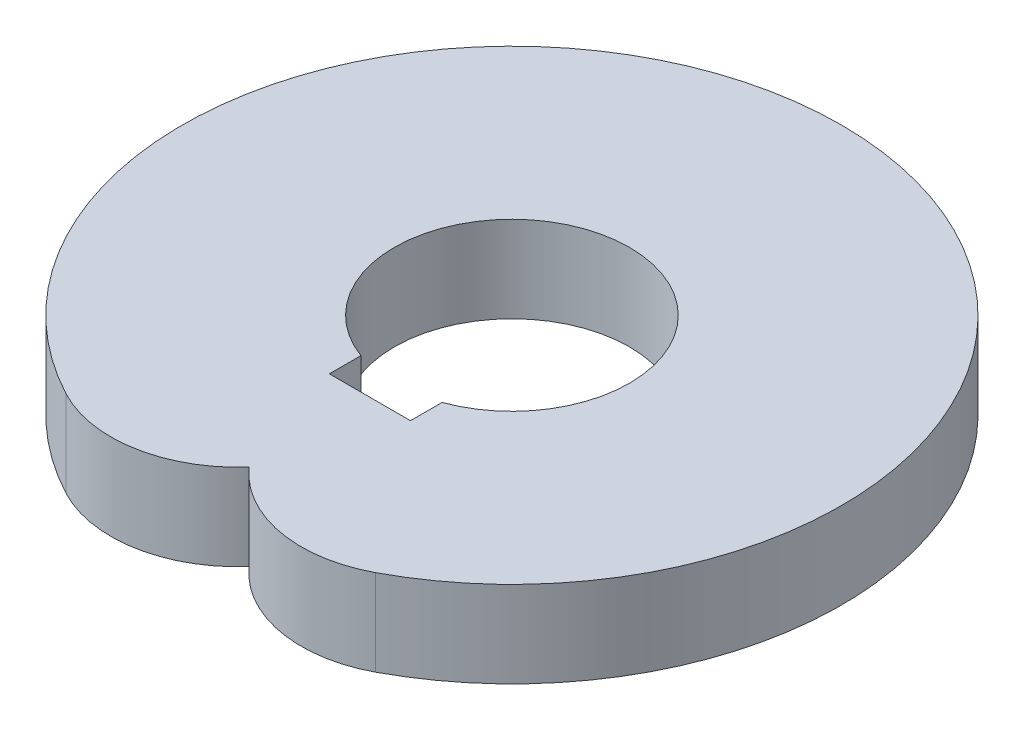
ISO-10303-21;
HEADER;
FILE_DESCRIPTION(('STEP AP214'),'2;1');
FILE_NAME('part.step','',(''),(''),'','','');
FILE_SCHEMA(('AUTOMOTIVE_DESIGN { 1 0 10303 214 1 1 1 1 }'));
ENDSEC;
DATA;
#1=APPLICATION_CONTEXT('core data for automotive mechanical design processes');
#2=APPLICATION_PROTOCOL_DEFINITION('international standard','automotive_design',2000,#1);
#3=PRODUCT_CONTEXT('',#1,'mechanical');
#4=PRODUCT('Part','Part','',(#3));
#5=PRODUCT_RELATED_PRODUCT_CATEGORY('part','',(#4));
#6=PRODUCT_DEFINITION_FORMATION('','',#4);
#7=PRODUCT_DEFINITION_CONTEXT('part definition',#1,'design');
#8=PRODUCT_DEFINITION('design','',#6,#7);
#9=PRODUCT_DEFINITION_SHAPE('','',#8);
#10=(LENGTH_UNIT() NAMED_UNIT(*) SI_UNIT(.MILLI.,.METRE.));
#11=(NAMED_UNIT(*) PLANE_ANGLE_UNIT() SI_UNIT($,.RADIAN.));
#12=(NAMED_UNIT(*) SI_UNIT($,.STERADIAN.) SOLID_ANGLE_UNIT());
#13=UNCERTAINTY_MEASURE_WITH_UNIT(LENGTH_MEASURE(1.E-05),#10,'distance_accuracy_value','');
#14=(GEOMETRIC_REPRESENTATION_CONTEXT(3) GLOBAL_UNCERTAINTY_ASSIGNED_CONTEXT((#13)) GLOBAL_UNIT_ASSIGNED_CONTEXT((#10,
#11,#12)) REPRESENTATION_CONTEXT('',''));
#15=CARTESIAN_POINT('',(0.,0.,0.));
#16=DIRECTION('',(0.,0.,1.));
#17=DIRECTION('',(1.,0.,0.));
#18=AXIS2_PLACEMENT_3D('',#15,#16,#17);
#19=CARTESIAN_POINT('',(93.8943125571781,0.,176.589518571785));
#20=DIRECTION('',(0.,1.,0.));
#21=DIRECTION('',(1.,0.,0.));
#22=AXIS2_PLACEMENT_3D('',#19,#20,#21);
#23=PLANE('',#22);
#24=CARTESIAN_POINT('',(187.788625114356,0.,353.17903714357));
#25=DIRECTION('',(0.,1.,0.));
#26=DIRECTION('',(1.,0.,0.));
#27=AXIS2_PLACEMENT_3D('',#24,#25,#26);
#28=CIRCLE('',#27,250.);
#29=CARTESIAN_POINT('',(0.,0.,518.210647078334));
#30=VERTEX_POINT('',#29);
#31=CARTESIAN_POINT('',(305.156515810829,0.,573.915935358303));
#32=VERTEX_POINT('',#31);
#33=EDGE_CURVE('E40',#30,#32,#28,.T.);
#34=ORIENTED_EDGE('',*,*,#33,.F.);
#35=CARTESIAN_POINT('',(-187.788625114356,0.,353.17903714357));
#36=DIRECTION('',(0.,1.,0.));
#37=DIRECTION('',(1.,0.,0.));
#38=AXIS2_PLACEMENT_3D('',#35,#36,#37);
#39=CIRCLE('',#38,250.);
#40=CARTESIAN_POINT('',(-305.156515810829,0.,573.915935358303));
#41=VERTEX_POINT('',#40);
#42=EDGE_CURVE('E128',#41,#30,#39,.T.);
#43=ORIENTED_EDGE('',*,*,#42,.F.);
#44=CARTESIAN_POINT('',(-2.22044604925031E-13,0.,0.));
#45=DIRECTION('',(0.,1.,0.));
#46=DIRECTION('',(1.,0.,0.));
#47=AXIS2_PLACEMENT_3D('',#44,#45,#46);
#48=CIRCLE('',#47,650.);
#49=EDGE_CURVE('E157',#32,#41,#48,.T.);
#50=ORIENTED_EDGE('',*,*,#49,.F.);
#51=EDGE_LOOP('',(#34,#43,#50));
#52=FACE_BOUND('',#51,.T.);
#53=DIRECTION('',(0.,0.,1.));
#54=VECTOR('',#53,1.);
#55=CARTESIAN_POINT('',(-80.,0.,0.));
#56=LINE('',#55,#54);
#57=CARTESIAN_POINT('',(-80.,0.,217.770521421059));
#58=VERTEX_POINT('',#57);
#59=CARTESIAN_POINT('',(-80.,0.,280.));
#60=VERTEX_POINT('',#59);
#61=EDGE_CURVE('E10',#58,#60,#56,.T.);
#62=ORIENTED_EDGE('',*,*,#61,.T.);
#63=DIRECTION('',(1.,0.,0.));
#64=VECTOR('',#63,1.);
#65=CARTESIAN_POINT('',(-80.,0.,280.));
#66=LINE('',#65,#64);
#67=CARTESIAN_POINT('',(80.,0.,280.));
#68=VERTEX_POINT('',#67);
#69=EDGE_CURVE('E26',#60,#68,#66,.T.);
#70=ORIENTED_EDGE('',*,*,#69,.T.);
#71=DIRECTION('',(0.,0.,-1.));
#72=VECTOR('',#71,1.);
#73=CARTESIAN_POINT('',(80.,0.,280.));
#74=LINE('',#73,#72);
#75=CARTESIAN_POINT('',(80.,0.,217.770521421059));
#76=VERTEX_POINT('',#75);
#77=EDGE_CURVE('E138',#68,#76,#74,.T.);
#78=ORIENTED_EDGE('',*,*,#77,.T.);
#79=CARTESIAN_POINT('',(0.,0.,0.));
#80=DIRECTION('',(0.,1.,0.));
#81=DIRECTION('',(1.,0.,0.));
#82=AXIS2_PLACEMENT_3D('',#79,#80,#81);
#83=CIRCLE('',#82,232.);
#84=EDGE_CURVE('E127',#76,#58,#83,.T.);
#85=ORIENTED_EDGE('',*,*,#84,.T.);
#86=EDGE_LOOP('',(#62,#70,#78,#85));
#87=FACE_BOUND('',#86,.T.);
#88=ADVANCED_FACE('F15',(#52,#87),#23,.F.);
#89=CARTESIAN_POINT('',(0.,170.,0.));
#90=DIRECTION('',(0.,1.,0.));
#91=DIRECTION('',(0.,0.,-1.));
#92=AXIS2_PLACEMENT_3D('',#89,#90,#91);
#93=CYLINDRICAL_SURFACE('',#92,232.);
#94=CARTESIAN_POINT('',(0.,170.,0.));
#95=DIRECTION('',(0.,1.,0.));
#96=DIRECTION('',(1.,0.,0.));
#97=AXIS2_PLACEMENT_3D('',#94,#95,#96);
#98=CIRCLE('',#97,232.);
#99=CARTESIAN_POINT('',(80.,170.,217.770521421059));
#100=VERTEX_POINT('',#99);
#101=CARTESIAN_POINT('',(-80.,170.,217.770521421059));
#102=VERTEX_POINT('',#101);
#103=EDGE_CURVE('E124',#100,#102,#98,.T.);
#104=ORIENTED_EDGE('',*,*,#103,.T.);
#105=DIRECTION('',(0.,-1.,0.));
#106=VECTOR('',#105,1.);
#107=CARTESIAN_POINT('',(-80.,170.,217.770521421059));
#108=LINE('',#107,#106);
#109=EDGE_CURVE('E110',#102,#58,#108,.T.);
#110=ORIENTED_EDGE('',*,*,#109,.T.);
#111=ORIENTED_EDGE('',*,*,#84,.F.);
#112=DIRECTION('',(0.,1.,0.));
#113=VECTOR('',#112,1.);
#114=CARTESIAN_POINT('',(80.,170.,217.770521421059));
#115=LINE('',#114,#113);
#116=EDGE_CURVE('E142',#76,#100,#115,.T.);
#117=ORIENTED_EDGE('',*,*,#116,.T.);
#118=EDGE_LOOP('',(#104,#110,#111,#117));
#119=FACE_BOUND('',#118,.T.);
#120=ADVANCED_FACE('F197',(#119),#93,.F.);
#121=CARTESIAN_POINT('',(93.8943125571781,170.,176.589518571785));
#122=DIRECTION('',(0.,1.,0.));
#123=DIRECTION('',(1.,0.,0.));
#124=AXIS2_PLACEMENT_3D('',#121,#122,#123);
#125=PLANE('',#124);
#126=CARTESIAN_POINT('',(187.788625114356,170.,353.17903714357));
#127=DIRECTION('',(0.,1.,0.));
#128=DIRECTION('',(1.,0.,0.));
#129=AXIS2_PLACEMENT_3D('',#126,#127,#128);
#130=CIRCLE('',#129,250.);
#131=CARTESIAN_POINT('',(0.,170.,518.210647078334));
#132=VERTEX_POINT('',#131);
#133=CARTESIAN_POINT('',(305.156515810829,170.,573.915935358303));
#134=VERTEX_POINT('',#133);
#135=EDGE_CURVE('E136',#132,#134,#130,.T.);
#136=ORIENTED_EDGE('',*,*,#135,.T.);
#137=CARTESIAN_POINT('',(-2.22044604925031E-13,170.,0.));
#138=DIRECTION('',(0.,1.,0.));
#139=DIRECTION('',(1.,0.,0.));
#140=AXIS2_PLACEMENT_3D('',#137,#138,#139);
#141=CIRCLE('',#140,650.);
#142=CARTESIAN_POINT('',(-305.156515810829,170.,573.915935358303));
#143=VERTEX_POINT('',#142);
#144=EDGE_CURVE('E133',#134,#143,#141,.T.);
#145=ORIENTED_EDGE('',*,*,#144,.T.);
#146=CARTESIAN_POINT('',(-187.788625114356,170.,353.17903714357));
#147=DIRECTION('',(0.,1.,0.));
#148=DIRECTION('',(1.,0.,0.));
#149=AXIS2_PLACEMENT_3D('',#146,#147,#148);
#150=CIRCLE('',#149,250.);
#151=EDGE_CURVE('E131',#143,#132,#150,.T.);
#152=ORIENTED_EDGE('',*,*,#151,.T.);
#153=EDGE_LOOP('',(#136,#145,#152));
#154=FACE_BOUND('',#153,.T.);
#155=DIRECTION('',(1.,0.,0.));
#156=VECTOR('',#155,1.);
#157=CARTESIAN_POINT('',(-80.,170.,280.));
#158=LINE('',#157,#156);
#159=CARTESIAN_POINT('',(-80.,170.,280.));
#160=VERTEX_POINT('',#159);
#161=CARTESIAN_POINT('',(80.,170.,280.));
#162=VERTEX_POINT('',#161);
#163=EDGE_CURVE('E92',#160,#162,#158,.T.);
#164=ORIENTED_EDGE('',*,*,#163,.F.);
#165=DIRECTION('',(0.,0.,1.));
#166=VECTOR('',#165,1.);
#167=CARTESIAN_POINT('',(-80.,170.,0.));
#168=LINE('',#167,#166);
#169=EDGE_CURVE('E96',#102,#160,#168,.T.);
#170=ORIENTED_EDGE('',*,*,#169,.F.);
#171=ORIENTED_EDGE('',*,*,#103,.F.);
#172=DIRECTION('',(0.,0.,-1.));
#173=VECTOR('',#172,1.);
#174=CARTESIAN_POINT('',(80.,170.,280.));
#175=LINE('',#174,#173);
#176=EDGE_CURVE('E19',#162,#100,#175,.T.);
#177=ORIENTED_EDGE('',*,*,#176,.F.);
#178=EDGE_LOOP('',(#164,#170,#171,#177));
#179=FACE_BOUND('',#178,.T.);
#180=ADVANCED_FACE('F94',(#154,#179),#125,.T.);
#181=CARTESIAN_POINT('',(-187.788625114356,170.,353.17903714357));
#182=DIRECTION('',(0.,1.,0.));
#183=DIRECTION('',(0.,0.,-1.));
#184=AXIS2_PLACEMENT_3D('',#181,#182,#183);
#185=CYLINDRICAL_SURFACE('',#184,250.);
#186=ORIENTED_EDGE('',*,*,#42,.T.);
#187=DIRECTION('',(0.,-1.,0.));
#188=VECTOR('',#187,1.);
#189=CARTESIAN_POINT('',(0.,170.,518.210647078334));
#190=LINE('',#189,#188);
#191=EDGE_CURVE('E113',#132,#30,#190,.T.);
#192=ORIENTED_EDGE('',*,*,#191,.F.);
#193=ORIENTED_EDGE('',*,*,#151,.F.);
#194=DIRECTION('',(0.,-1.,0.));
#195=VECTOR('',#194,1.);
#196=CARTESIAN_POINT('',(-305.156515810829,170.,573.915935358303));
#197=LINE('',#196,#195);
#198=EDGE_CURVE('E132',#143,#41,#197,.T.);
#199=ORIENTED_EDGE('',*,*,#198,.T.);
#200=EDGE_LOOP('',(#186,#192,#193,#199));
#201=FACE_BOUND('',#200,.T.);
#202=ADVANCED_FACE('F182',(#201),#185,.T.);
#203=CARTESIAN_POINT('',(-2.22044604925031E-13,170.,0.));
#204=DIRECTION('',(0.,1.,0.));
#205=DIRECTION('',(0.,0.,-1.));
#206=AXIS2_PLACEMENT_3D('',#203,#204,#205);
#207=CYLINDRICAL_SURFACE('',#206,650.);
#208=ORIENTED_EDGE('',*,*,#49,.T.);
#209=ORIENTED_EDGE('',*,*,#198,.F.);
#210=ORIENTED_EDGE('',*,*,#144,.F.);
#211=DIRECTION('',(0.,-1.,0.));
#212=VECTOR('',#211,1.);
#213=CARTESIAN_POINT('',(305.156515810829,170.,573.915935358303));
#214=LINE('',#213,#212);
#215=EDGE_CURVE('E159',#134,#32,#214,.T.);
#216=ORIENTED_EDGE('',*,*,#215,.T.);
#217=EDGE_LOOP('',(#208,#209,#210,#216));
#218=FACE_BOUND('',#217,.T.);
#219=ADVANCED_FACE('F185',(#218),#207,.T.);
#220=CARTESIAN_POINT('',(187.788625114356,170.,353.17903714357));
#221=DIRECTION('',(0.,1.,0.));
#222=DIRECTION('',(0.,0.,-1.));
#223=AXIS2_PLACEMENT_3D('',#220,#221,#222);
#224=CYLINDRICAL_SURFACE('',#223,250.);
#225=ORIENTED_EDGE('',*,*,#33,.T.);
#226=ORIENTED_EDGE('',*,*,#215,.F.);
#227=ORIENTED_EDGE('',*,*,#135,.F.);
#228=ORIENTED_EDGE('',*,*,#191,.T.);
#229=EDGE_LOOP('',(#225,#226,#227,#228));
#230=FACE_BOUND('',#229,.T.);
#231=ADVANCED_FACE('F181',(#230),#224,.T.);
#232=CARTESIAN_POINT('',(-80.,170.,0.));
#233=DIRECTION('',(1.,0.,0.));
#234=DIRECTION('',(0.,1.,0.));
#235=AXIS2_PLACEMENT_3D('',#232,#233,#234);
#236=PLANE('',#235);
#237=ORIENTED_EDGE('',*,*,#169,.T.);
#238=DIRECTION('',(0.,-1.,0.));
#239=VECTOR('',#238,1.);
#240=CARTESIAN_POINT('',(-80.,170.,280.));
#241=LINE('',#240,#239);
#242=EDGE_CURVE('E103',#160,#60,#241,.T.);
#243=ORIENTED_EDGE('',*,*,#242,.T.);
#244=ORIENTED_EDGE('',*,*,#61,.F.);
#245=ORIENTED_EDGE('',*,*,#109,.F.);
#246=EDGE_LOOP('',(#237,#243,#244,#245));
#247=FACE_BOUND('',#246,.T.);
#248=ADVANCED_FACE('F17',(#247),#236,.T.);
#249=CARTESIAN_POINT('',(-80.,170.,280.));
#250=DIRECTION('',(0.,0.,-1.));
#251=DIRECTION('',(0.,-1.,0.));
#252=AXIS2_PLACEMENT_3D('',#249,#250,#251);
#253=PLANE('',#252);
#254=ORIENTED_EDGE('',*,*,#69,.F.);
#255=ORIENTED_EDGE('',*,*,#242,.F.);
#256=ORIENTED_EDGE('',*,*,#163,.T.);
#257=DIRECTION('',(0.,-1.,0.));
#258=VECTOR('',#257,1.);
#259=CARTESIAN_POINT('',(80.,170.,280.));
#260=LINE('',#259,#258);
#261=EDGE_CURVE('E104',#162,#68,#260,.T.);
#262=ORIENTED_EDGE('',*,*,#261,.T.);
#263=EDGE_LOOP('',(#254,#255,#256,#262));
#264=FACE_BOUND('',#263,.T.);
#265=ADVANCED_FACE('F115',(#264),#253,.T.);
#266=CARTESIAN_POINT('',(80.,170.,280.));
#267=DIRECTION('',(-1.,0.,0.));
#268=DIRECTION('',(0.,0.,1.));
#269=AXIS2_PLACEMENT_3D('',#266,#267,#268);
#270=PLANE('',#269);
#271=ORIENTED_EDGE('',*,*,#77,.F.);
#272=ORIENTED_EDGE('',*,*,#261,.F.);
#273=ORIENTED_EDGE('',*,*,#176,.T.);
#274=ORIENTED_EDGE('',*,*,#116,.F.);
#275=EDGE_LOOP('',(#271,#272,#273,#274));
#276=FACE_BOUND('',#275,.T.);
#277=ADVANCED_FACE('F206',(#276),#270,.T.);
#278=CLOSED_SHELL('',(#88,#120,#180,#202,#219,#231,#248,#265,#277));
#279=MANIFOLD_SOLID_BREP('B1',#278);
#280=ADVANCED_BREP_SHAPE_REPRESENTATION('',(#18,#279),#14);
#281=SHAPE_DEFINITION_REPRESENTATION(#9,#280);
ENDSEC;
END-ISO-10303-21;
